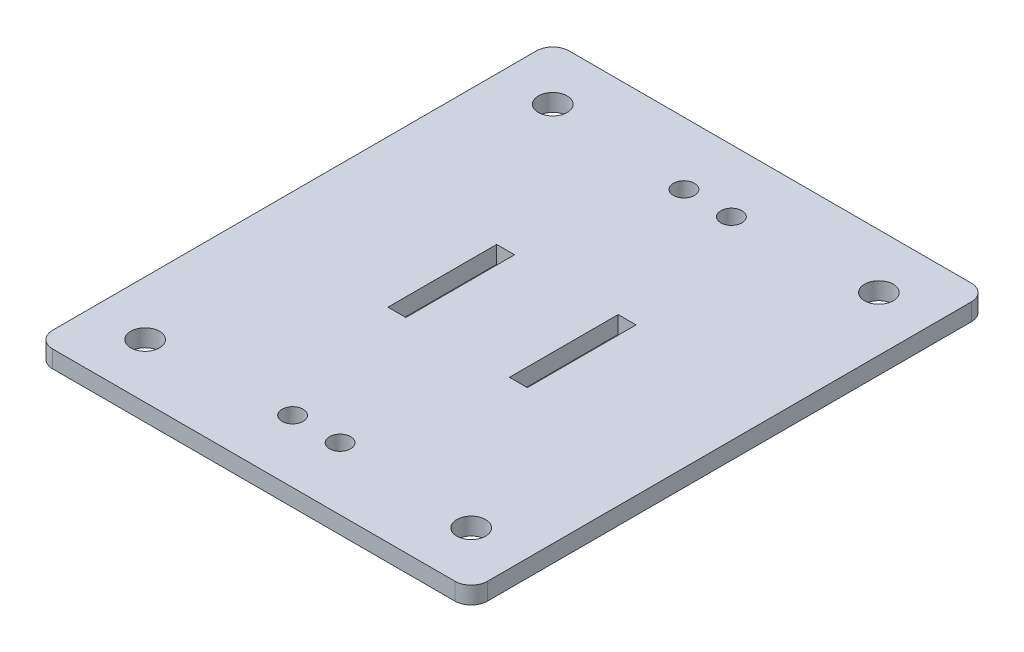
from build123d import *

# Parameters (mm, degrees)
SKETCH1_W           = 80
SKETCH1_H           = 95
SKETCH1_R           = 1.9431
SKETCH1_R_2         = 2.65
SKETCH1_W_2         = 3.3
SKETCH1_H_2         = 20
BOSS_EXTRUDE1_DEPTH = 3.175
FILLET1_R           = 3


with BuildPart() as part:
    # Sketch1 → Boss-Extrude1 (new body)
    with BuildSketch(Plane(origin=(0, 0, 0), x_dir=(1, 0, 0), z_dir=(0, 1, 0))):
        with Locations((40, 47.5)):
            Rectangle(SKETCH1_W, SKETCH1_H)
        with Locations(Location((44.3688, 83.5, 0), (0, 0, 270))):
            Circle(SKETCH1_R, mode=Mode.SUBTRACT)
        with Locations(Location((35.6312, 83.5, 0), (0, 0, 90))):
            Circle(SKETCH1_R, mode=Mode.SUBTRACT)
        with Locations(Location((44.3688, 11.5, 0), (0, 0, 90))):
            Circle(SKETCH1_R, mode=Mode.SUBTRACT)
        with Locations(Location((35.6312, 11.5, 0), (0, 0, 270))):
            Circle(SKETCH1_R, mode=Mode.SUBTRACT)
        with Locations(Location((70, 10, 0), (0, 0, 270))):
            Circle(SKETCH1_R_2, mode=Mode.SUBTRACT)
        with Locations(Location((10, 10, 0), (0, 0, 270))):
            Circle(SKETCH1_R_2, mode=Mode.SUBTRACT)
        with Locations(Location((70, 85, 0), (0, 0, 270))):
            Circle(SKETCH1_R_2, mode=Mode.SUBTRACT)
        with Locations(Location((10, 85, 0), (0, 0, 270))):
            Circle(SKETCH1_R_2, mode=Mode.SUBTRACT)
        with Locations((28.825, 47.5)):
            Rectangle(SKETCH1_W_2, SKETCH1_H_2, mode=Mode.SUBTRACT)
        with Locations((51.175, 47.5)):
            Rectangle(SKETCH1_W_2, SKETCH1_H_2, mode=Mode.SUBTRACT)
    extrude(amount=BOSS_EXTRUDE1_DEPTH)

    # Fillet1
    fillet1_edges = [part.edges().sort_by_distance(p)[0] for p in [
        (0, 1.5875, -95),
        (80, 1.5875, -95),
        (80, 1.5875, 0),
        (0, 1.5875, 0),
    ]]
    fillet(fillet1_edges, radius=FILLET1_R)


solid = part.part
